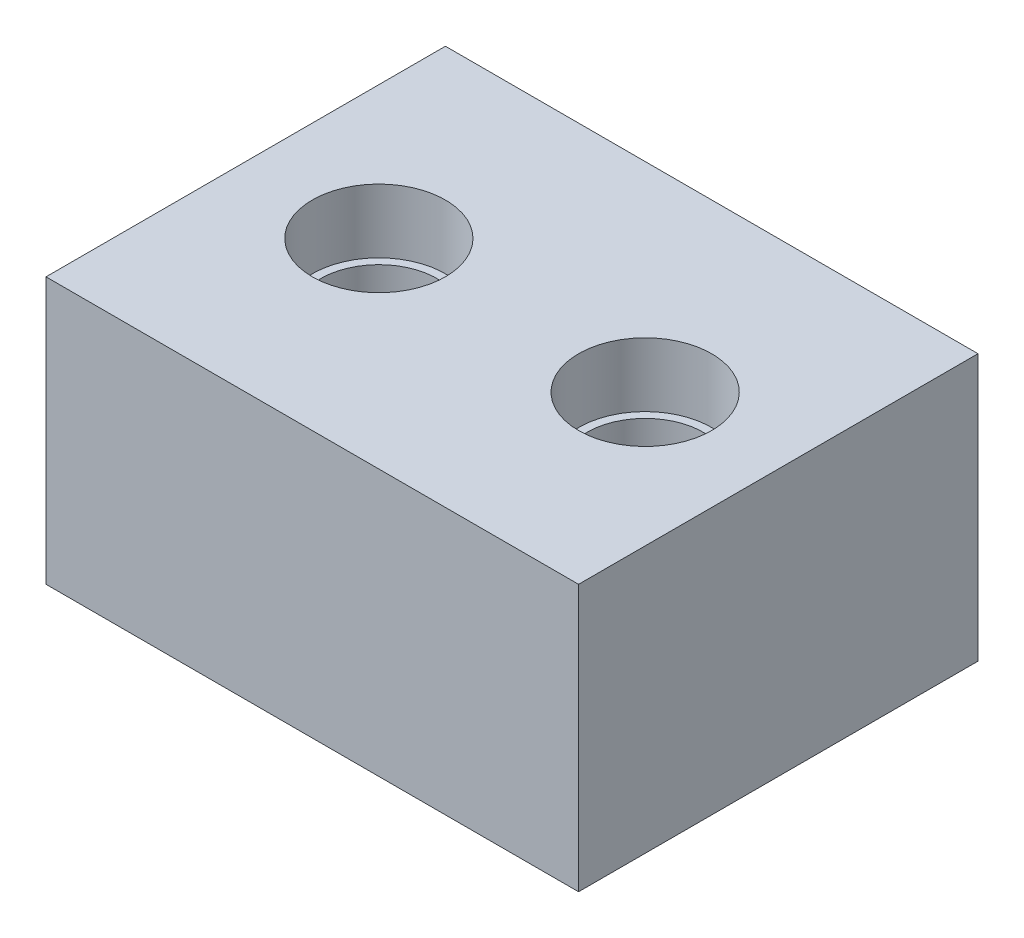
ISO-10303-21;
HEADER;
FILE_DESCRIPTION(('STEP AP214'),'2;1');
FILE_NAME('part.step','',(''),(''),'','','');
FILE_SCHEMA(('AUTOMOTIVE_DESIGN { 1 0 10303 214 1 1 1 1 }'));
ENDSEC;
DATA;
#1=APPLICATION_CONTEXT('core data for automotive mechanical design processes');
#2=APPLICATION_PROTOCOL_DEFINITION('international standard','automotive_design',2000,#1);
#3=PRODUCT_CONTEXT('',#1,'mechanical');
#4=PRODUCT('Part','Part','',(#3));
#5=PRODUCT_RELATED_PRODUCT_CATEGORY('part','',(#4));
#6=PRODUCT_DEFINITION_FORMATION('','',#4);
#7=PRODUCT_DEFINITION_CONTEXT('part definition',#1,'design');
#8=PRODUCT_DEFINITION('design','',#6,#7);
#9=PRODUCT_DEFINITION_SHAPE('','',#8);
#10=(LENGTH_UNIT() NAMED_UNIT(*) SI_UNIT(.MILLI.,.METRE.));
#11=(NAMED_UNIT(*) PLANE_ANGLE_UNIT() SI_UNIT($,.RADIAN.));
#12=(NAMED_UNIT(*) SI_UNIT($,.STERADIAN.) SOLID_ANGLE_UNIT());
#13=UNCERTAINTY_MEASURE_WITH_UNIT(LENGTH_MEASURE(1.E-05),#10,'distance_accuracy_value','');
#14=(GEOMETRIC_REPRESENTATION_CONTEXT(3) GLOBAL_UNCERTAINTY_ASSIGNED_CONTEXT((#13)) GLOBAL_UNIT_ASSIGNED_CONTEXT((#10,
#11,#12)) REPRESENTATION_CONTEXT('',''));
#15=CARTESIAN_POINT('',(0.,0.,0.));
#16=DIRECTION('',(0.,0.,1.));
#17=DIRECTION('',(1.,0.,0.));
#18=AXIS2_PLACEMENT_3D('',#15,#16,#17);
#19=CARTESIAN_POINT('',(25.4,25.4,19.05));
#20=DIRECTION('',(-1.,0.,0.));
#21=DIRECTION('',(0.,0.,1.));
#22=AXIS2_PLACEMENT_3D('',#19,#20,#21);
#23=PLANE('',#22);
#24=DIRECTION('',(0.,0.,-1.));
#25=VECTOR('',#24,1.);
#26=CARTESIAN_POINT('',(25.4,0.,19.05));
#27=LINE('',#26,#25);
#28=CARTESIAN_POINT('',(25.4,0.,19.05));
#29=VERTEX_POINT('',#28);
#30=CARTESIAN_POINT('',(25.4,0.,-19.05));
#31=VERTEX_POINT('',#30);
#32=EDGE_CURVE('E104',#29,#31,#27,.T.);
#33=ORIENTED_EDGE('',*,*,#32,.T.);
#34=DIRECTION('',(0.,-1.,0.));
#35=VECTOR('',#34,1.);
#36=CARTESIAN_POINT('',(25.4,25.4,-19.05));
#37=LINE('',#36,#35);
#38=CARTESIAN_POINT('',(25.4,25.4,-19.05));
#39=VERTEX_POINT('',#38);
#40=EDGE_CURVE('E12',#39,#31,#37,.T.);
#41=ORIENTED_EDGE('',*,*,#40,.F.);
#42=DIRECTION('',(0.,0.,-1.));
#43=VECTOR('',#42,1.);
#44=CARTESIAN_POINT('',(25.4,25.4,19.05));
#45=LINE('',#44,#43);
#46=CARTESIAN_POINT('',(25.4,25.4,19.05));
#47=VERTEX_POINT('',#46);
#48=EDGE_CURVE('E92',#47,#39,#45,.T.);
#49=ORIENTED_EDGE('',*,*,#48,.F.);
#50=DIRECTION('',(0.,-1.,0.));
#51=VECTOR('',#50,1.);
#52=CARTESIAN_POINT('',(25.4,25.4,19.05));
#53=LINE('',#52,#51);
#54=EDGE_CURVE('E100',#47,#29,#53,.T.);
#55=ORIENTED_EDGE('',*,*,#54,.T.);
#56=EDGE_LOOP('',(#33,#41,#49,#55));
#57=FACE_BOUND('',#56,.T.);
#58=ADVANCED_FACE('F41',(#57),#23,.F.);
#59=CARTESIAN_POINT('',(-25.4,25.4,-19.05));
#60=DIRECTION('',(0.,0.,1.));
#61=DIRECTION('',(1.,0.,0.));
#62=AXIS2_PLACEMENT_3D('',#59,#60,#61);
#63=PLANE('',#62);
#64=DIRECTION('',(-1.,0.,0.));
#65=VECTOR('',#64,1.);
#66=CARTESIAN_POINT('',(-25.4,0.,-19.05));
#67=LINE('',#66,#65);
#68=CARTESIAN_POINT('',(-25.4,0.,-19.05));
#69=VERTEX_POINT('',#68);
#70=EDGE_CURVE('E96',#31,#69,#67,.T.);
#71=ORIENTED_EDGE('',*,*,#70,.T.);
#72=DIRECTION('',(0.,-1.,0.));
#73=VECTOR('',#72,1.);
#74=CARTESIAN_POINT('',(-25.4,25.4,-19.05));
#75=LINE('',#74,#73);
#76=CARTESIAN_POINT('',(-25.4,25.4,-19.05));
#77=VERTEX_POINT('',#76);
#78=EDGE_CURVE('E49',#77,#69,#75,.T.);
#79=ORIENTED_EDGE('',*,*,#78,.F.);
#80=DIRECTION('',(-1.,0.,0.));
#81=VECTOR('',#80,1.);
#82=CARTESIAN_POINT('',(-25.4,25.4,-19.05));
#83=LINE('',#82,#81);
#84=EDGE_CURVE('E87',#39,#77,#83,.T.);
#85=ORIENTED_EDGE('',*,*,#84,.F.);
#86=ORIENTED_EDGE('',*,*,#40,.T.);
#87=EDGE_LOOP('',(#71,#79,#85,#86));
#88=FACE_BOUND('',#87,.T.);
#89=ADVANCED_FACE('F95',(#88),#63,.F.);
#90=CARTESIAN_POINT('',(-25.4,25.4,19.05));
#91=DIRECTION('',(1.,0.,0.));
#92=DIRECTION('',(0.,0.,-1.));
#93=AXIS2_PLACEMENT_3D('',#90,#91,#92);
#94=PLANE('',#93);
#95=DIRECTION('',(0.,0.,1.));
#96=VECTOR('',#95,1.);
#97=CARTESIAN_POINT('',(-25.4,0.,19.05));
#98=LINE('',#97,#96);
#99=CARTESIAN_POINT('',(-25.4,0.,19.05));
#100=VERTEX_POINT('',#99);
#101=EDGE_CURVE('E74',#69,#100,#98,.T.);
#102=ORIENTED_EDGE('',*,*,#101,.T.);
#103=DIRECTION('',(0.,-1.,0.));
#104=VECTOR('',#103,1.);
#105=CARTESIAN_POINT('',(-25.4,25.4,19.05));
#106=LINE('',#105,#104);
#107=CARTESIAN_POINT('',(-25.4,25.4,19.05));
#108=VERTEX_POINT('',#107);
#109=EDGE_CURVE('E97',#108,#100,#106,.T.);
#110=ORIENTED_EDGE('',*,*,#109,.F.);
#111=DIRECTION('',(0.,0.,1.));
#112=VECTOR('',#111,1.);
#113=CARTESIAN_POINT('',(-25.4,25.4,19.05));
#114=LINE('',#113,#112);
#115=EDGE_CURVE('E90',#77,#108,#114,.T.);
#116=ORIENTED_EDGE('',*,*,#115,.F.);
#117=ORIENTED_EDGE('',*,*,#78,.T.);
#118=EDGE_LOOP('',(#102,#110,#116,#117));
#119=FACE_BOUND('',#118,.T.);
#120=ADVANCED_FACE('F98',(#119),#94,.F.);
#121=CARTESIAN_POINT('',(-25.4,25.4,19.05));
#122=DIRECTION('',(0.,0.,-1.));
#123=DIRECTION('',(-1.,0.,0.));
#124=AXIS2_PLACEMENT_3D('',#121,#122,#123);
#125=PLANE('',#124);
#126=DIRECTION('',(1.,0.,0.));
#127=VECTOR('',#126,1.);
#128=CARTESIAN_POINT('',(-25.4,0.,19.05));
#129=LINE('',#128,#127);
#130=EDGE_CURVE('E80',#100,#29,#129,.T.);
#131=ORIENTED_EDGE('',*,*,#130,.T.);
#132=ORIENTED_EDGE('',*,*,#54,.F.);
#133=DIRECTION('',(1.,0.,0.));
#134=VECTOR('',#133,1.);
#135=CARTESIAN_POINT('',(-25.4,25.4,19.05));
#136=LINE('',#135,#134);
#137=EDGE_CURVE('E57',#108,#47,#136,.T.);
#138=ORIENTED_EDGE('',*,*,#137,.F.);
#139=ORIENTED_EDGE('',*,*,#109,.T.);
#140=EDGE_LOOP('',(#131,#132,#138,#139));
#141=FACE_BOUND('',#140,.T.);
#142=ADVANCED_FACE('F174',(#141),#125,.F.);
#143=CARTESIAN_POINT('',(0.,25.4,0.));
#144=DIRECTION('',(0.,-1.,0.));
#145=DIRECTION('',(0.,0.,-1.));
#146=AXIS2_PLACEMENT_3D('',#143,#144,#145);
#147=PLANE('',#146);
#148=CARTESIAN_POINT('',(-12.7,25.4,0.));
#149=DIRECTION('',(0.,1.,0.));
#150=DIRECTION('',(0.,0.,1.));
#151=AXIS2_PLACEMENT_3D('',#148,#149,#150);
#152=CIRCLE('',#151,6.35);
#153=CARTESIAN_POINT('',(-12.7,25.4,6.35000000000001));
#154=VERTEX_POINT('',#153);
#155=EDGE_CURVE('E127',#154,#154,#152,.T.);
#156=ORIENTED_EDGE('',*,*,#155,.F.);
#157=EDGE_LOOP('',(#156));
#158=FACE_BOUND('',#157,.T.);
#159=CARTESIAN_POINT('',(12.7,25.4,0.));
#160=DIRECTION('',(0.,1.,0.));
#161=DIRECTION('',(0.,0.,1.));
#162=AXIS2_PLACEMENT_3D('',#159,#160,#161);
#163=CIRCLE('',#162,6.35);
#164=CARTESIAN_POINT('',(12.7,25.4,6.34999999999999));
#165=VERTEX_POINT('',#164);
#166=EDGE_CURVE('E138',#165,#165,#163,.T.);
#167=ORIENTED_EDGE('',*,*,#166,.F.);
#168=EDGE_LOOP('',(#167));
#169=FACE_BOUND('',#168,.T.);
#170=ORIENTED_EDGE('',*,*,#48,.T.);
#171=ORIENTED_EDGE('',*,*,#84,.T.);
#172=ORIENTED_EDGE('',*,*,#115,.T.);
#173=ORIENTED_EDGE('',*,*,#137,.T.);
#174=EDGE_LOOP('',(#170,#171,#172,#173));
#175=FACE_BOUND('',#174,.T.);
#176=ADVANCED_FACE('F88',(#158,#169,#175),#147,.F.);
#177=CARTESIAN_POINT('',(0.,0.,0.));
#178=DIRECTION('',(0.,-1.,0.));
#179=DIRECTION('',(0.,0.,-1.));
#180=AXIS2_PLACEMENT_3D('',#177,#178,#179);
#181=PLANE('',#180);
#182=CARTESIAN_POINT('',(-12.7,0.,0.));
#183=DIRECTION('',(0.,1.,0.));
#184=DIRECTION('',(0.,0.,1.));
#185=AXIS2_PLACEMENT_3D('',#182,#183,#184);
#186=CIRCLE('',#185,3.57124);
#187=CARTESIAN_POINT('',(-12.7,0.,3.57124000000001));
#188=VERTEX_POINT('',#187);
#189=EDGE_CURVE('E322',#188,#188,#186,.T.);
#190=ORIENTED_EDGE('',*,*,#189,.T.);
#191=EDGE_LOOP('',(#190));
#192=FACE_BOUND('',#191,.T.);
#193=CARTESIAN_POINT('',(12.7,0.,0.));
#194=DIRECTION('',(0.,1.,0.));
#195=DIRECTION('',(0.,0.,1.));
#196=AXIS2_PLACEMENT_3D('',#193,#194,#195);
#197=CIRCLE('',#196,3.57124000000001);
#198=CARTESIAN_POINT('',(12.7,0.,3.57124));
#199=VERTEX_POINT('',#198);
#200=EDGE_CURVE('E128',#199,#199,#197,.T.);
#201=ORIENTED_EDGE('',*,*,#200,.T.);
#202=EDGE_LOOP('',(#201));
#203=FACE_BOUND('',#202,.T.);
#204=ORIENTED_EDGE('',*,*,#32,.F.);
#205=ORIENTED_EDGE('',*,*,#130,.F.);
#206=ORIENTED_EDGE('',*,*,#101,.F.);
#207=ORIENTED_EDGE('',*,*,#70,.F.);
#208=EDGE_LOOP('',(#204,#205,#206,#207));
#209=FACE_BOUND('',#208,.T.);
#210=ADVANCED_FACE('F173',(#192,#203,#209),#181,.T.);
#211=CARTESIAN_POINT('',(12.7,19.304,0.));
#212=DIRECTION('',(0.,1.,0.));
#213=DIRECTION('',(0.,0.,1.));
#214=AXIS2_PLACEMENT_3D('',#211,#212,#213);
#215=CYLINDRICAL_SURFACE('',#214,6.35);
#216=CARTESIAN_POINT('',(12.7,19.304,0.));
#217=DIRECTION('',(0.,1.,0.));
#218=DIRECTION('',(0.,0.,1.));
#219=AXIS2_PLACEMENT_3D('',#216,#217,#218);
#220=CIRCLE('',#219,6.35);
#221=CARTESIAN_POINT('',(12.7,19.304,6.34999999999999));
#222=VERTEX_POINT('',#221);
#223=EDGE_CURVE('E134',#222,#222,#220,.T.);
#224=CARTESIAN_POINT('',(12.7,19.304,6.34999999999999));
#225=CARTESIAN_POINT('',(12.7,19.3675,6.34999999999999));
#226=CARTESIAN_POINT('',(12.7,19.431,6.34999999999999));
#227=CARTESIAN_POINT('',(12.7,19.558,6.34999999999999));
#228=CARTESIAN_POINT('',(12.7,19.6215,6.34999999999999));
#229=CARTESIAN_POINT('',(12.7,19.7485,6.34999999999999));
#230=CARTESIAN_POINT('',(12.7,19.812,6.34999999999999));
#231=CARTESIAN_POINT('',(12.7,19.939,6.34999999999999));
#232=CARTESIAN_POINT('',(12.7,20.0025,6.34999999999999));
#233=CARTESIAN_POINT('',(12.7,20.1295,6.34999999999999));
#234=CARTESIAN_POINT('',(12.7,20.193,6.34999999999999));
#235=CARTESIAN_POINT('',(12.7,20.32,6.34999999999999));
#236=CARTESIAN_POINT('',(12.7,20.3835,6.34999999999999));
#237=CARTESIAN_POINT('',(12.7,20.5105,6.34999999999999));
#238=CARTESIAN_POINT('',(12.7,20.574,6.34999999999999));
#239=CARTESIAN_POINT('',(12.7,20.701,6.34999999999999));
#240=CARTESIAN_POINT('',(12.7,20.7645,6.34999999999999));
#241=CARTESIAN_POINT('',(12.7,20.8915,6.34999999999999));
#242=CARTESIAN_POINT('',(12.7,20.955,6.34999999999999));
#243=CARTESIAN_POINT('',(12.7,21.082,6.34999999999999));
#244=CARTESIAN_POINT('',(12.7,21.1455,6.34999999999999));
#245=CARTESIAN_POINT('',(12.7,21.2725,6.34999999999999));
#246=CARTESIAN_POINT('',(12.7,21.336,6.34999999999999));
#247=CARTESIAN_POINT('',(12.7,21.463,6.34999999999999));
#248=CARTESIAN_POINT('',(12.7,21.5265,6.34999999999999));
#249=CARTESIAN_POINT('',(12.7,21.6535,6.34999999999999));
#250=CARTESIAN_POINT('',(12.7,21.717,6.34999999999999));
#251=CARTESIAN_POINT('',(12.7,21.844,6.34999999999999));
#252=CARTESIAN_POINT('',(12.7,21.9075,6.34999999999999));
#253=CARTESIAN_POINT('',(12.7,22.0345,6.34999999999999));
#254=CARTESIAN_POINT('',(12.7,22.098,6.34999999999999));
#255=CARTESIAN_POINT('',(12.7,22.225,6.34999999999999));
#256=CARTESIAN_POINT('',(12.7,22.2885,6.34999999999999));
#257=CARTESIAN_POINT('',(12.7,22.4155,6.34999999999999));
#258=CARTESIAN_POINT('',(12.7,22.479,6.34999999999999));
#259=CARTESIAN_POINT('',(12.7,22.606,6.34999999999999));
#260=CARTESIAN_POINT('',(12.7,22.6695,6.34999999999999));
#261=CARTESIAN_POINT('',(12.7,22.7965,6.34999999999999));
#262=CARTESIAN_POINT('',(12.7,22.86,6.34999999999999));
#263=CARTESIAN_POINT('',(12.7,22.987,6.34999999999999));
#264=CARTESIAN_POINT('',(12.7,23.0505,6.34999999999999));
#265=CARTESIAN_POINT('',(12.7,23.1775,6.34999999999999));
#266=CARTESIAN_POINT('',(12.7,23.241,6.34999999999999));
#267=CARTESIAN_POINT('',(12.7,23.368,6.34999999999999));
#268=CARTESIAN_POINT('',(12.7,23.4315,6.34999999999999));
#269=CARTESIAN_POINT('',(12.7,23.5585,6.34999999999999));
#270=CARTESIAN_POINT('',(12.7,23.622,6.34999999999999));
#271=CARTESIAN_POINT('',(12.7,23.749,6.34999999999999));
#272=CARTESIAN_POINT('',(12.7,23.8125,6.34999999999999));
#273=CARTESIAN_POINT('',(12.7,23.9395,6.34999999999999));
#274=CARTESIAN_POINT('',(12.7,24.003,6.34999999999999));
#275=CARTESIAN_POINT('',(12.7,24.13,6.34999999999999));
#276=CARTESIAN_POINT('',(12.7,24.1935,6.34999999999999));
#277=CARTESIAN_POINT('',(12.7,24.3205,6.34999999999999));
#278=CARTESIAN_POINT('',(12.7,24.384,6.34999999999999));
#279=CARTESIAN_POINT('',(12.7,24.511,6.34999999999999));
#280=CARTESIAN_POINT('',(12.7,24.5745,6.34999999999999));
#281=CARTESIAN_POINT('',(12.7,24.7015,6.34999999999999));
#282=CARTESIAN_POINT('',(12.7,24.765,6.34999999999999));
#283=CARTESIAN_POINT('',(12.7,24.892,6.34999999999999));
#284=CARTESIAN_POINT('',(12.7,24.9555,6.34999999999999));
#285=CARTESIAN_POINT('',(12.7,25.0825,6.34999999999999));
#286=CARTESIAN_POINT('',(12.7,25.146,6.34999999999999));
#287=CARTESIAN_POINT('',(12.7,25.273,6.34999999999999));
#288=CARTESIAN_POINT('',(12.7,25.3365,6.34999999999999));
#289=CARTESIAN_POINT('',(12.7,25.4,6.34999999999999));
#290=B_SPLINE_CURVE_WITH_KNOTS('',3,(#224,#225,#226,#227,#228,#229,#230,#231,#232,#233,#234,
#235,#236,#237,#238,#239,#240,#241,#242,#243,#244,#245,#246,#247,#248,#249,#250,#251,#252,#253,
#254,#255,#256,#257,#258,#259,#260,#261,#262,#263,#264,#265,#266,#267,#268,#269,#270,#271,#272,
#273,#274,#275,#276,#277,#278,#279,#280,#281,#282,#283,#284,#285,#286,#287,#288,#289),
.UNSPECIFIED.,.F.,.F.,(4,2,2,2,2,2,2,2,2,2,2,2,2,2,2,2,2,2,2,2,2,2,2,2,2,2,2,2,2,2,2,2,4),(0.,
0.190500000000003,0.381000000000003,0.571500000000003,0.762000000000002,0.952500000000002,1.143,
1.3335,1.524,1.7145,1.905,2.0955,2.286,2.4765,2.667,2.8575,3.048,3.2385,3.429,3.6195,3.81,
4.0005,4.191,4.3815,4.572,4.7625,4.953,5.1435,5.334,5.5245,5.715,5.9055,6.096),.UNSPECIFIED.);
#291=EDGE_CURVE('BSEAM170',#222,#165,#290,.T.);
#292=ORIENTED_EDGE('',*,*,#223,.F.);
#293=ORIENTED_EDGE('',*,*,#166,.T.);
#294=ORIENTED_EDGE('',*,*,#291,.T.);
#295=ORIENTED_EDGE('',*,*,#291,.F.);
#296=EDGE_LOOP('',(#292,#294,#293,#295));
#297=FACE_BOUND('',#296,.T.);
#298=ADVANCED_FACE('F170',(#297),#215,.F.);
#299=CARTESIAN_POINT('',(12.7,19.304,0.));
#300=DIRECTION('',(0.,1.,0.));
#301=DIRECTION('',(0.,0.,1.));
#302=AXIS2_PLACEMENT_3D('',#299,#300,#301);
#303=PLANE('',#302);
#304=CARTESIAN_POINT('',(12.7,19.304,0.));
#305=DIRECTION('',(0.,1.,0.));
#306=DIRECTION('',(0.,0.,1.));
#307=AXIS2_PLACEMENT_3D('',#304,#305,#306);
#308=CIRCLE('',#307,5.55625);
#309=CARTESIAN_POINT('',(12.7,19.304,5.55624999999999));
#310=VERTEX_POINT('',#309);
#311=EDGE_CURVE('E154',#310,#310,#308,.T.);
#312=ORIENTED_EDGE('',*,*,#311,.F.);
#313=EDGE_LOOP('',(#312));
#314=FACE_BOUND('',#313,.T.);
#315=ORIENTED_EDGE('',*,*,#223,.T.);
#316=EDGE_LOOP('',(#315));
#317=FACE_BOUND('',#316,.T.);
#318=ADVANCED_FACE('F220',(#314,#317),#303,.T.);
#319=CARTESIAN_POINT('',(-12.7,19.304,0.));
#320=DIRECTION('',(0.,1.,0.));
#321=DIRECTION('',(0.,0.,1.));
#322=AXIS2_PLACEMENT_3D('',#319,#320,#321);
#323=CYLINDRICAL_SURFACE('',#322,6.35);
#324=CARTESIAN_POINT('',(-12.7,19.304,0.));
#325=DIRECTION('',(0.,1.,0.));
#326=DIRECTION('',(0.,0.,1.));
#327=AXIS2_PLACEMENT_3D('',#324,#325,#326);
#328=CIRCLE('',#327,6.35);
#329=CARTESIAN_POINT('',(-12.7,19.304,6.35000000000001));
#330=VERTEX_POINT('',#329);
#331=EDGE_CURVE('E107',#330,#330,#328,.T.);
#332=CARTESIAN_POINT('',(-12.7,19.304,6.35000000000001));
#333=CARTESIAN_POINT('',(-12.7,19.3675,6.35000000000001));
#334=CARTESIAN_POINT('',(-12.7,19.431,6.35000000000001));
#335=CARTESIAN_POINT('',(-12.7,19.558,6.35000000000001));
#336=CARTESIAN_POINT('',(-12.7,19.6215,6.35000000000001));
#337=CARTESIAN_POINT('',(-12.7,19.7485,6.35000000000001));
#338=CARTESIAN_POINT('',(-12.7,19.812,6.35000000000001));
#339=CARTESIAN_POINT('',(-12.7,19.939,6.35000000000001));
#340=CARTESIAN_POINT('',(-12.7,20.0025,6.35000000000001));
#341=CARTESIAN_POINT('',(-12.7,20.1295,6.35000000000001));
#342=CARTESIAN_POINT('',(-12.7,20.193,6.35000000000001));
#343=CARTESIAN_POINT('',(-12.7,20.32,6.35000000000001));
#344=CARTESIAN_POINT('',(-12.7,20.3835,6.35000000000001));
#345=CARTESIAN_POINT('',(-12.7,20.5105,6.35000000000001));
#346=CARTESIAN_POINT('',(-12.7,20.574,6.35000000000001));
#347=CARTESIAN_POINT('',(-12.7,20.701,6.35000000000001));
#348=CARTESIAN_POINT('',(-12.7,20.7645,6.35000000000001));
#349=CARTESIAN_POINT('',(-12.7,20.8915,6.35000000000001));
#350=CARTESIAN_POINT('',(-12.7,20.955,6.35000000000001));
#351=CARTESIAN_POINT('',(-12.7,21.082,6.35000000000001));
#352=CARTESIAN_POINT('',(-12.7,21.1455,6.35000000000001));
#353=CARTESIAN_POINT('',(-12.7,21.2725,6.35000000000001));
#354=CARTESIAN_POINT('',(-12.7,21.336,6.35000000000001));
#355=CARTESIAN_POINT('',(-12.7,21.463,6.35000000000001));
#356=CARTESIAN_POINT('',(-12.7,21.5265,6.35000000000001));
#357=CARTESIAN_POINT('',(-12.7,21.6535,6.35000000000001));
#358=CARTESIAN_POINT('',(-12.7,21.717,6.35000000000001));
#359=CARTESIAN_POINT('',(-12.7,21.844,6.35000000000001));
#360=CARTESIAN_POINT('',(-12.7,21.9075,6.35000000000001));
#361=CARTESIAN_POINT('',(-12.7,22.0345,6.35000000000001));
#362=CARTESIAN_POINT('',(-12.7,22.098,6.35000000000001));
#363=CARTESIAN_POINT('',(-12.7,22.225,6.35000000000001));
#364=CARTESIAN_POINT('',(-12.7,22.2885,6.35000000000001));
#365=CARTESIAN_POINT('',(-12.7,22.4155,6.35000000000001));
#366=CARTESIAN_POINT('',(-12.7,22.479,6.35000000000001));
#367=CARTESIAN_POINT('',(-12.7,22.606,6.35000000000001));
#368=CARTESIAN_POINT('',(-12.7,22.6695,6.35000000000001));
#369=CARTESIAN_POINT('',(-12.7,22.7965,6.35000000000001));
#370=CARTESIAN_POINT('',(-12.7,22.86,6.35000000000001));
#371=CARTESIAN_POINT('',(-12.7,22.987,6.35000000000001));
#372=CARTESIAN_POINT('',(-12.7,23.0505,6.35000000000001));
#373=CARTESIAN_POINT('',(-12.7,23.1775,6.35000000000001));
#374=CARTESIAN_POINT('',(-12.7,23.241,6.35000000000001));
#375=CARTESIAN_POINT('',(-12.7,23.368,6.35000000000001));
#376=CARTESIAN_POINT('',(-12.7,23.4315,6.35000000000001));
#377=CARTESIAN_POINT('',(-12.7,23.5585,6.35000000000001));
#378=CARTESIAN_POINT('',(-12.7,23.622,6.35000000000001));
#379=CARTESIAN_POINT('',(-12.7,23.749,6.35000000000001));
#380=CARTESIAN_POINT('',(-12.7,23.8125,6.35000000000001));
#381=CARTESIAN_POINT('',(-12.7,23.9395,6.35000000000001));
#382=CARTESIAN_POINT('',(-12.7,24.003,6.35000000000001));
#383=CARTESIAN_POINT('',(-12.7,24.13,6.35000000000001));
#384=CARTESIAN_POINT('',(-12.7,24.1935,6.35000000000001));
#385=CARTESIAN_POINT('',(-12.7,24.3205,6.35000000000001));
#386=CARTESIAN_POINT('',(-12.7,24.384,6.35000000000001));
#387=CARTESIAN_POINT('',(-12.7,24.511,6.35000000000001));
#388=CARTESIAN_POINT('',(-12.7,24.5745,6.35000000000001));
#389=CARTESIAN_POINT('',(-12.7,24.7015,6.35000000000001));
#390=CARTESIAN_POINT('',(-12.7,24.765,6.35000000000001));
#391=CARTESIAN_POINT('',(-12.7,24.892,6.35000000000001));
#392=CARTESIAN_POINT('',(-12.7,24.9555,6.35000000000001));
#393=CARTESIAN_POINT('',(-12.7,25.0825,6.35000000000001));
#394=CARTESIAN_POINT('',(-12.7,25.146,6.35000000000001));
#395=CARTESIAN_POINT('',(-12.7,25.273,6.35000000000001));
#396=CARTESIAN_POINT('',(-12.7,25.3365,6.35000000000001));
#397=CARTESIAN_POINT('',(-12.7,25.4,6.35000000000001));
#398=B_SPLINE_CURVE_WITH_KNOTS('',3,(#332,#333,#334,#335,#336,#337,#338,#339,#340,#341,#342,
#343,#344,#345,#346,#347,#348,#349,#350,#351,#352,#353,#354,#355,#356,#357,#358,#359,#360,#361,
#362,#363,#364,#365,#366,#367,#368,#369,#370,#371,#372,#373,#374,#375,#376,#377,#378,#379,#380,
#381,#382,#383,#384,#385,#386,#387,#388,#389,#390,#391,#392,#393,#394,#395,#396,#397),
.UNSPECIFIED.,.F.,.F.,(4,2,2,2,2,2,2,2,2,2,2,2,2,2,2,2,2,2,2,2,2,2,2,2,2,2,2,2,2,2,2,2,4),(0.,
0.190500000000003,0.381000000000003,0.571500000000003,0.762000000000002,0.952500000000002,1.143,
1.3335,1.524,1.7145,1.905,2.0955,2.286,2.4765,2.667,2.8575,3.048,3.2385,3.429,3.6195,3.81,
4.0005,4.191,4.3815,4.572,4.7625,4.953,5.1435,5.334,5.5245,5.715,5.9055,6.096),.UNSPECIFIED.);
#399=EDGE_CURVE('BSEAM225',#330,#154,#398,.T.);
#400=ORIENTED_EDGE('',*,*,#331,.F.);
#401=ORIENTED_EDGE('',*,*,#155,.T.);
#402=ORIENTED_EDGE('',*,*,#399,.T.);
#403=ORIENTED_EDGE('',*,*,#399,.F.);
#404=EDGE_LOOP('',(#400,#402,#401,#403));
#405=FACE_BOUND('',#404,.T.);
#406=ADVANCED_FACE('F225',(#405),#323,.F.);
#407=CARTESIAN_POINT('',(-12.7,19.304,0.));
#408=DIRECTION('',(0.,1.,0.));
#409=DIRECTION('',(0.,0.,1.));
#410=AXIS2_PLACEMENT_3D('',#407,#408,#409);
#411=PLANE('',#410);
#412=CARTESIAN_POINT('',(-12.7,19.304,0.));
#413=DIRECTION('',(0.,1.,0.));
#414=DIRECTION('',(0.,0.,1.));
#415=AXIS2_PLACEMENT_3D('',#412,#413,#414);
#416=CIRCLE('',#415,5.55625);
#417=CARTESIAN_POINT('',(-12.7,19.304,5.55625));
#418=VERTEX_POINT('',#417);
#419=EDGE_CURVE('E335',#418,#418,#416,.T.);
#420=ORIENTED_EDGE('',*,*,#419,.F.);
#421=EDGE_LOOP('',(#420));
#422=FACE_BOUND('',#421,.T.);
#423=ORIENTED_EDGE('',*,*,#331,.T.);
#424=EDGE_LOOP('',(#423));
#425=FACE_BOUND('',#424,.T.);
#426=ADVANCED_FACE('F242',(#422,#425),#411,.T.);
#427=CARTESIAN_POINT('',(12.7,19.304,0.));
#428=DIRECTION('',(0.,1.,0.));
#429=DIRECTION('',(0.,0.,1.));
#430=AXIS2_PLACEMENT_3D('',#427,#428,#429);
#431=CYLINDRICAL_SURFACE('',#430,3.57124);
#432=ORIENTED_EDGE('',*,*,#200,.F.);
#433=EDGE_LOOP('',(#432));
#434=FACE_BOUND('',#433,.T.);
#435=CARTESIAN_POINT('',(12.7,12.954,0.));
#436=DIRECTION('',(0.,1.,0.));
#437=DIRECTION('',(0.,0.,1.));
#438=AXIS2_PLACEMENT_3D('',#435,#436,#437);
#439=CIRCLE('',#438,3.57124);
#440=CARTESIAN_POINT('',(12.7,12.954,3.57123999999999));
#441=VERTEX_POINT('',#440);
#442=EDGE_CURVE('E153',#441,#441,#439,.T.);
#443=ORIENTED_EDGE('',*,*,#442,.T.);
#444=EDGE_LOOP('',(#443));
#445=FACE_BOUND('',#444,.T.);
#446=ADVANCED_FACE('F246',(#434,#445),#431,.F.);
#447=CARTESIAN_POINT('',(16.27124,12.954,0.));
#448=DIRECTION('',(0.,-1.,0.));
#449=DIRECTION('',(0.,0.,-1.));
#450=AXIS2_PLACEMENT_3D('',#447,#448,#449);
#451=PLANE('',#450);
#452=ORIENTED_EDGE('',*,*,#442,.F.);
#453=EDGE_LOOP('',(#452));
#454=FACE_BOUND('',#453,.T.);
#455=CARTESIAN_POINT('',(12.7,12.954,0.));
#456=DIRECTION('',(0.,1.,0.));
#457=DIRECTION('',(0.,0.,1.));
#458=AXIS2_PLACEMENT_3D('',#455,#456,#457);
#459=CIRCLE('',#458,5.55625);
#460=CARTESIAN_POINT('',(12.7,12.954,5.55624999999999));
#461=VERTEX_POINT('',#460);
#462=EDGE_CURVE('E150',#461,#461,#459,.T.);
#463=ORIENTED_EDGE('',*,*,#462,.T.);
#464=EDGE_LOOP('',(#463));
#465=FACE_BOUND('',#464,.T.);
#466=ADVANCED_FACE('F296',(#454,#465),#451,.F.);
#467=CARTESIAN_POINT('',(12.7,19.304,0.));
#468=DIRECTION('',(0.,1.,0.));
#469=DIRECTION('',(0.,0.,1.));
#470=AXIS2_PLACEMENT_3D('',#467,#468,#469);
#471=CYLINDRICAL_SURFACE('',#470,5.55625);
#472=ORIENTED_EDGE('',*,*,#462,.F.);
#473=EDGE_LOOP('',(#472));
#474=FACE_BOUND('',#473,.T.);
#475=ORIENTED_EDGE('',*,*,#311,.T.);
#476=EDGE_LOOP('',(#475));
#477=FACE_BOUND('',#476,.T.);
#478=ADVANCED_FACE('F267',(#474,#477),#471,.F.);
#479=CARTESIAN_POINT('',(-12.7,19.304,0.));
#480=DIRECTION('',(0.,1.,0.));
#481=DIRECTION('',(0.,0.,1.));
#482=AXIS2_PLACEMENT_3D('',#479,#480,#481);
#483=CYLINDRICAL_SURFACE('',#482,3.57124);
#484=ORIENTED_EDGE('',*,*,#189,.F.);
#485=EDGE_LOOP('',(#484));
#486=FACE_BOUND('',#485,.T.);
#487=CARTESIAN_POINT('',(-12.7,12.954,0.));
#488=DIRECTION('',(0.,1.,0.));
#489=DIRECTION('',(0.,0.,1.));
#490=AXIS2_PLACEMENT_3D('',#487,#488,#489);
#491=CIRCLE('',#490,3.57124);
#492=CARTESIAN_POINT('',(-12.7,12.954,3.57124));
#493=VERTEX_POINT('',#492);
#494=EDGE_CURVE('E325',#493,#493,#491,.T.);
#495=ORIENTED_EDGE('',*,*,#494,.T.);
#496=EDGE_LOOP('',(#495));
#497=FACE_BOUND('',#496,.T.);
#498=ADVANCED_FACE('F261',(#486,#497),#483,.F.);
#499=CARTESIAN_POINT('',(-9.12876,12.954,0.));
#500=DIRECTION('',(0.,-1.,0.));
#501=DIRECTION('',(0.,0.,-1.));
#502=AXIS2_PLACEMENT_3D('',#499,#500,#501);
#503=PLANE('',#502);
#504=ORIENTED_EDGE('',*,*,#494,.F.);
#505=EDGE_LOOP('',(#504));
#506=FACE_BOUND('',#505,.T.);
#507=CARTESIAN_POINT('',(-12.7,12.954,0.));
#508=DIRECTION('',(0.,1.,0.));
#509=DIRECTION('',(0.,0.,1.));
#510=AXIS2_PLACEMENT_3D('',#507,#508,#509);
#511=CIRCLE('',#510,5.55625);
#512=CARTESIAN_POINT('',(-12.7,12.954,5.55625));
#513=VERTEX_POINT('',#512);
#514=EDGE_CURVE('E329',#513,#513,#511,.T.);
#515=ORIENTED_EDGE('',*,*,#514,.T.);
#516=EDGE_LOOP('',(#515));
#517=FACE_BOUND('',#516,.T.);
#518=ADVANCED_FACE('F266',(#506,#517),#503,.F.);
#519=CARTESIAN_POINT('',(-12.7,19.304,0.));
#520=DIRECTION('',(0.,1.,0.));
#521=DIRECTION('',(0.,0.,1.));
#522=AXIS2_PLACEMENT_3D('',#519,#520,#521);
#523=CYLINDRICAL_SURFACE('',#522,5.55625);
#524=ORIENTED_EDGE('',*,*,#514,.F.);
#525=EDGE_LOOP('',(#524));
#526=FACE_BOUND('',#525,.T.);
#527=ORIENTED_EDGE('',*,*,#419,.T.);
#528=EDGE_LOOP('',(#527));
#529=FACE_BOUND('',#528,.T.);
#530=ADVANCED_FACE('F277',(#526,#529),#523,.F.);
#531=CLOSED_SHELL('',(#58,#89,#120,#142,#176,#210,#298,#318,#406,#426,#446,#466,#478,#498,#518,#530));
#532=MANIFOLD_SOLID_BREP('B2',#531);
#533=ADVANCED_BREP_SHAPE_REPRESENTATION('',(#18,#532),#14);
#534=SHAPE_DEFINITION_REPRESENTATION(#9,#533);
ENDSEC;
END-ISO-10303-21;
